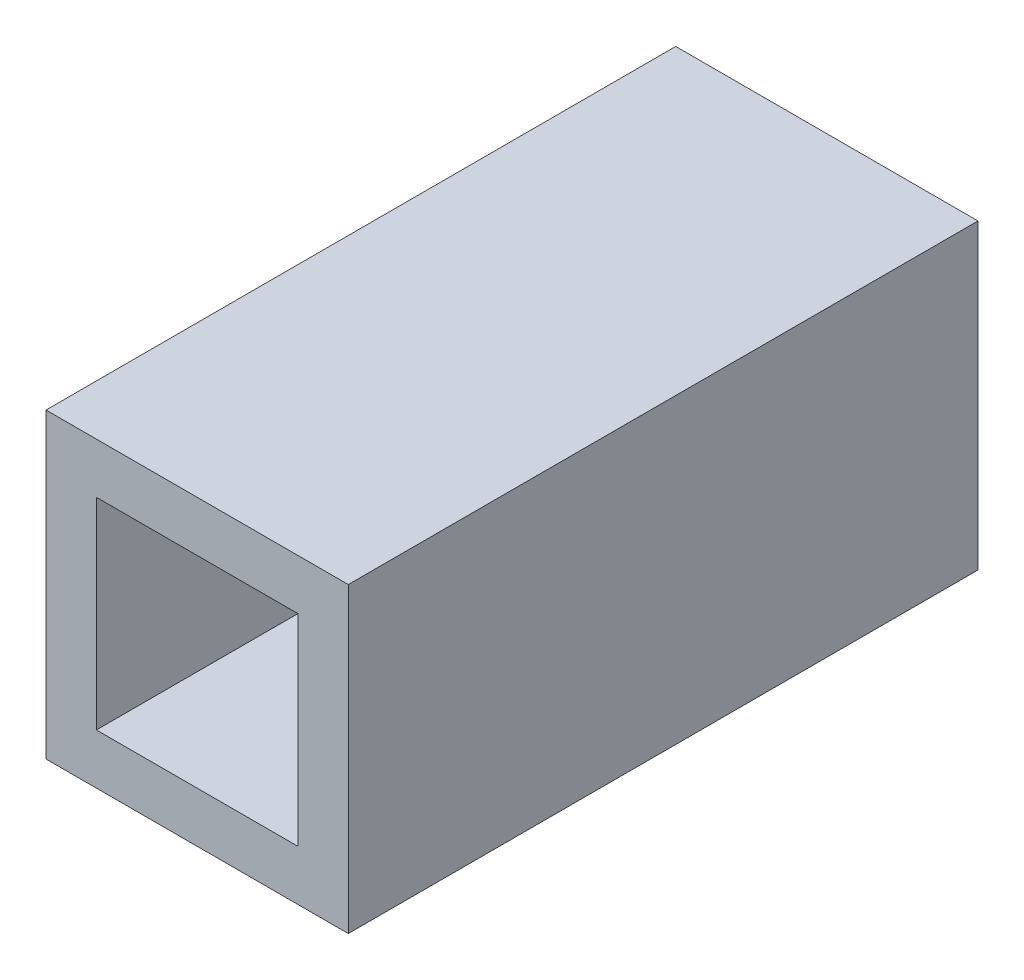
from build123d import *

# Parameters (mm, degrees)
SKETCH1_W           = 120
SKETCH1_H           = 120
BOSS_EXTRUDE1_DEPTH = 125
SKETCH2_W           = 80
SKETCH2_H           = 80
CUT_EXTRUDE1_DEPTH  = 265.007575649
SKETCH3_W           = 40
SKETCH3_H           = 20
CUT_EXTRUDE2_DEPTH  = 10


with BuildPart() as part:
    # Sketch1 → Boss-Extrude1 (new, symmetric)
    with BuildSketch(Plane.XY):
        Rectangle(SKETCH1_W, SKETCH1_H)
    extrude(amount=BOSS_EXTRUDE1_DEPTH, both=True)

    # Sketch2 → Cut-Extrude1 (cut, through all)
    with BuildSketch(Plane(origin=(0, 0, -125), x_dir=(-1, 0, 0), z_dir=(0, 0, -1))):
        Rectangle(SKETCH2_W, SKETCH2_H)
    extrude(amount=-CUT_EXTRUDE1_DEPTH, mode=Mode.SUBTRACT)

    # Sketch3 → Cut-Extrude2 (cut)
    with BuildSketch(Plane.ZY.offset(60)):
        Rectangle(SKETCH3_W, SKETCH3_H)
    extrude(amount=-CUT_EXTRUDE2_DEPTH, mode=Mode.SUBTRACT)


solid = part.part
